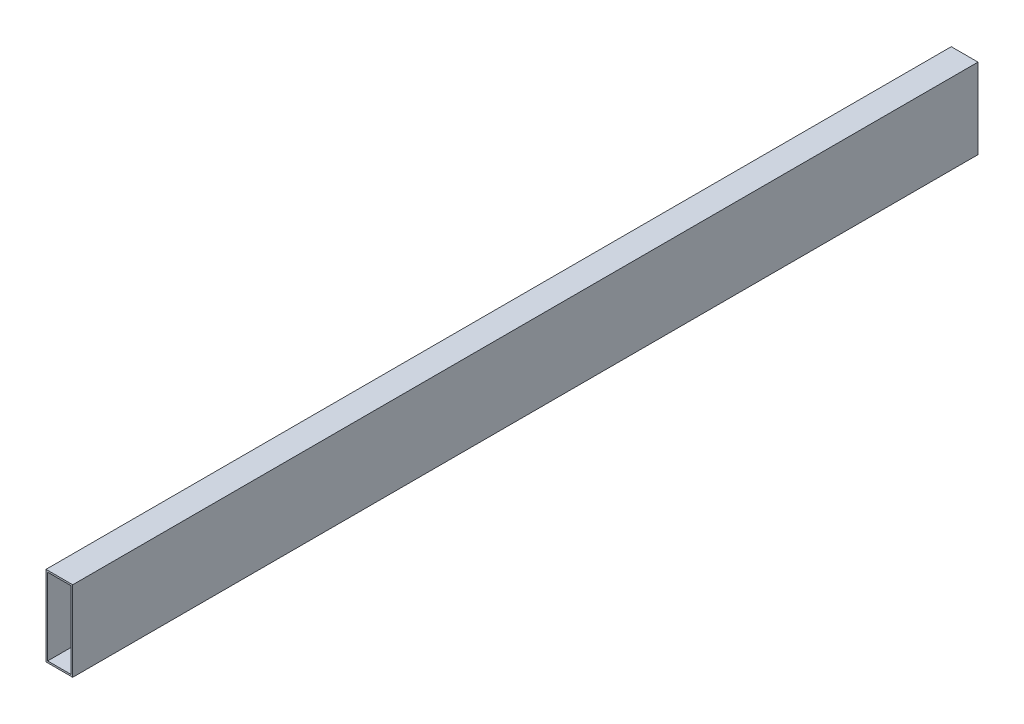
ISO-10303-21;
HEADER;
FILE_DESCRIPTION(('STEP AP214'),'2;1');
FILE_NAME('part.step','',(''),(''),'','','');
FILE_SCHEMA(('AUTOMOTIVE_DESIGN { 1 0 10303 214 1 1 1 1 }'));
ENDSEC;
DATA;
#1=APPLICATION_CONTEXT('core data for automotive mechanical design processes');
#2=APPLICATION_PROTOCOL_DEFINITION('international standard','automotive_design',2000,#1);
#3=PRODUCT_CONTEXT('',#1,'mechanical');
#4=PRODUCT('Part','Part','',(#3));
#5=PRODUCT_RELATED_PRODUCT_CATEGORY('part','',(#4));
#6=PRODUCT_DEFINITION_FORMATION('','',#4);
#7=PRODUCT_DEFINITION_CONTEXT('part definition',#1,'design');
#8=PRODUCT_DEFINITION('design','',#6,#7);
#9=PRODUCT_DEFINITION_SHAPE('','',#8);
#10=(LENGTH_UNIT() NAMED_UNIT(*) SI_UNIT(.MILLI.,.METRE.));
#11=(NAMED_UNIT(*) PLANE_ANGLE_UNIT() SI_UNIT($,.RADIAN.));
#12=(NAMED_UNIT(*) SI_UNIT($,.STERADIAN.) SOLID_ANGLE_UNIT());
#13=UNCERTAINTY_MEASURE_WITH_UNIT(LENGTH_MEASURE(1.E-05),#10,'distance_accuracy_value','');
#14=(GEOMETRIC_REPRESENTATION_CONTEXT(3) GLOBAL_UNCERTAINTY_ASSIGNED_CONTEXT((#13)) GLOBAL_UNIT_ASSIGNED_CONTEXT((#10,
#11,#12)) REPRESENTATION_CONTEXT('',''));
#15=CARTESIAN_POINT('',(0.,0.,0.));
#16=DIRECTION('',(0.,0.,1.));
#17=DIRECTION('',(1.,0.,0.));
#18=AXIS2_PLACEMENT_3D('',#15,#16,#17);
#19=CARTESIAN_POINT('',(50.8,152.4,0.));
#20=DIRECTION('',(0.,1.,0.));
#21=DIRECTION('',(0.,0.,1.));
#22=AXIS2_PLACEMENT_3D('',#19,#20,#21);
#23=PLANE('',#22);
#24=DIRECTION('',(-1.,0.,0.));
#25=VECTOR('',#24,1.);
#26=CARTESIAN_POINT('',(50.8,152.4,1720.85));
#27=LINE('',#26,#25);
#28=CARTESIAN_POINT('',(50.8,152.4,1720.85));
#29=VERTEX_POINT('',#28);
#30=CARTESIAN_POINT('',(0.,152.4,1720.85));
#31=VERTEX_POINT('',#30);
#32=EDGE_CURVE('E129',#29,#31,#27,.T.);
#33=ORIENTED_EDGE('',*,*,#32,.F.);
#34=DIRECTION('',(0.,0.,1.));
#35=VECTOR('',#34,1.);
#36=CARTESIAN_POINT('',(50.8,152.4,0.));
#37=LINE('',#36,#35);
#38=CARTESIAN_POINT('',(50.8,152.4,0.));
#39=VERTEX_POINT('',#38);
#40=EDGE_CURVE('E11',#39,#29,#37,.T.);
#41=ORIENTED_EDGE('',*,*,#40,.F.);
#42=DIRECTION('',(-1.,0.,0.));
#43=VECTOR('',#42,1.);
#44=CARTESIAN_POINT('',(50.8,152.4,0.));
#45=LINE('',#44,#43);
#46=CARTESIAN_POINT('',(0.,152.4,0.));
#47=VERTEX_POINT('',#46);
#48=EDGE_CURVE('E133',#39,#47,#45,.T.);
#49=ORIENTED_EDGE('',*,*,#48,.T.);
#50=DIRECTION('',(0.,0.,1.));
#51=VECTOR('',#50,1.);
#52=CARTESIAN_POINT('',(0.,152.4,0.));
#53=LINE('',#52,#51);
#54=EDGE_CURVE('E34',#47,#31,#53,.T.);
#55=ORIENTED_EDGE('',*,*,#54,.T.);
#56=EDGE_LOOP('',(#33,#41,#49,#55));
#57=FACE_BOUND('',#56,.T.);
#58=ADVANCED_FACE('F31',(#57),#23,.T.);
#59=CARTESIAN_POINT('',(50.8,0.,0.));
#60=DIRECTION('',(1.,0.,0.));
#61=DIRECTION('',(0.,0.,-1.));
#62=AXIS2_PLACEMENT_3D('',#59,#60,#61);
#63=PLANE('',#62);
#64=DIRECTION('',(0.,1.,0.));
#65=VECTOR('',#64,1.);
#66=CARTESIAN_POINT('',(50.8,0.,1720.85));
#67=LINE('',#66,#65);
#68=CARTESIAN_POINT('',(50.8,0.,1720.85));
#69=VERTEX_POINT('',#68);
#70=EDGE_CURVE('E137',#69,#29,#67,.T.);
#71=ORIENTED_EDGE('',*,*,#70,.F.);
#72=DIRECTION('',(0.,0.,1.));
#73=VECTOR('',#72,1.);
#74=CARTESIAN_POINT('',(50.8,0.,0.));
#75=LINE('',#74,#73);
#76=CARTESIAN_POINT('',(50.8,0.,0.));
#77=VERTEX_POINT('',#76);
#78=EDGE_CURVE('E39',#77,#69,#75,.T.);
#79=ORIENTED_EDGE('',*,*,#78,.F.);
#80=DIRECTION('',(0.,1.,0.));
#81=VECTOR('',#80,1.);
#82=CARTESIAN_POINT('',(50.8,0.,0.));
#83=LINE('',#82,#81);
#84=EDGE_CURVE('E143',#77,#39,#83,.T.);
#85=ORIENTED_EDGE('',*,*,#84,.T.);
#86=ORIENTED_EDGE('',*,*,#40,.T.);
#87=EDGE_LOOP('',(#71,#79,#85,#86));
#88=FACE_BOUND('',#87,.T.);
#89=ADVANCED_FACE('F169',(#88),#63,.T.);
#90=CARTESIAN_POINT('',(0.,0.,0.));
#91=DIRECTION('',(0.,-1.,0.));
#92=DIRECTION('',(0.,0.,-1.));
#93=AXIS2_PLACEMENT_3D('',#90,#91,#92);
#94=PLANE('',#93);
#95=DIRECTION('',(1.,0.,0.));
#96=VECTOR('',#95,1.);
#97=CARTESIAN_POINT('',(0.,0.,1720.85));
#98=LINE('',#97,#96);
#99=CARTESIAN_POINT('',(0.,0.,1720.85));
#100=VERTEX_POINT('',#99);
#101=EDGE_CURVE('E151',#100,#69,#98,.T.);
#102=ORIENTED_EDGE('',*,*,#101,.F.);
#103=DIRECTION('',(0.,0.,1.));
#104=VECTOR('',#103,1.);
#105=CARTESIAN_POINT('',(0.,0.,0.));
#106=LINE('',#105,#104);
#107=CARTESIAN_POINT('',(0.,0.,0.));
#108=VERTEX_POINT('',#107);
#109=EDGE_CURVE('E156',#108,#100,#106,.T.);
#110=ORIENTED_EDGE('',*,*,#109,.F.);
#111=DIRECTION('',(1.,0.,0.));
#112=VECTOR('',#111,1.);
#113=CARTESIAN_POINT('',(0.,0.,0.));
#114=LINE('',#113,#112);
#115=EDGE_CURVE('E140',#108,#77,#114,.T.);
#116=ORIENTED_EDGE('',*,*,#115,.T.);
#117=ORIENTED_EDGE('',*,*,#78,.T.);
#118=EDGE_LOOP('',(#102,#110,#116,#117));
#119=FACE_BOUND('',#118,.T.);
#120=ADVANCED_FACE('F173',(#119),#94,.T.);
#121=CARTESIAN_POINT('',(0.,152.4,0.));
#122=DIRECTION('',(-1.,0.,0.));
#123=DIRECTION('',(0.,-1.,0.));
#124=AXIS2_PLACEMENT_3D('',#121,#122,#123);
#125=PLANE('',#124);
#126=DIRECTION('',(0.,-1.,0.));
#127=VECTOR('',#126,1.);
#128=CARTESIAN_POINT('',(0.,152.4,1720.85));
#129=LINE('',#128,#127);
#130=EDGE_CURVE('E148',#31,#100,#129,.T.);
#131=ORIENTED_EDGE('',*,*,#130,.F.);
#132=ORIENTED_EDGE('',*,*,#54,.F.);
#133=DIRECTION('',(0.,-1.,0.));
#134=VECTOR('',#133,1.);
#135=CARTESIAN_POINT('',(0.,152.4,0.));
#136=LINE('',#135,#134);
#137=EDGE_CURVE('E136',#47,#108,#136,.T.);
#138=ORIENTED_EDGE('',*,*,#137,.T.);
#139=ORIENTED_EDGE('',*,*,#109,.T.);
#140=EDGE_LOOP('',(#131,#132,#138,#139));
#141=FACE_BOUND('',#140,.T.);
#142=ADVANCED_FACE('F164',(#141),#125,.T.);
#143=CARTESIAN_POINT('',(0.,152.4,0.));
#144=DIRECTION('',(0.,0.,1.));
#145=DIRECTION('',(1.,0.,0.));
#146=AXIS2_PLACEMENT_3D('',#143,#144,#145);
#147=PLANE('',#146);
#148=DIRECTION('',(0.,-1.,0.));
#149=VECTOR('',#148,1.);
#150=CARTESIAN_POINT('',(3.175,3.175,0.));
#151=LINE('',#150,#149);
#152=CARTESIAN_POINT('',(3.17499999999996,149.225,0.));
#153=VERTEX_POINT('',#152);
#154=CARTESIAN_POINT('',(3.175,3.175,0.));
#155=VERTEX_POINT('',#154);
#156=EDGE_CURVE('E104',#153,#155,#151,.T.);
#157=ORIENTED_EDGE('',*,*,#156,.T.);
#158=DIRECTION('',(1.,0.,0.));
#159=VECTOR('',#158,1.);
#160=CARTESIAN_POINT('',(47.625,3.175,0.));
#161=LINE('',#160,#159);
#162=CARTESIAN_POINT('',(47.625,3.175,0.));
#163=VERTEX_POINT('',#162);
#164=EDGE_CURVE('E98',#155,#163,#161,.T.);
#165=ORIENTED_EDGE('',*,*,#164,.T.);
#166=DIRECTION('',(0.,1.,0.));
#167=VECTOR('',#166,1.);
#168=CARTESIAN_POINT('',(47.625,149.225,0.));
#169=LINE('',#168,#167);
#170=CARTESIAN_POINT('',(47.625,149.225,0.));
#171=VERTEX_POINT('',#170);
#172=EDGE_CURVE('E107',#163,#171,#169,.T.);
#173=ORIENTED_EDGE('',*,*,#172,.T.);
#174=DIRECTION('',(-1.,0.,0.));
#175=VECTOR('',#174,1.);
#176=CARTESIAN_POINT('',(3.17499999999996,149.225,0.));
#177=LINE('',#176,#175);
#178=EDGE_CURVE('E47',#171,#153,#177,.T.);
#179=ORIENTED_EDGE('',*,*,#178,.T.);
#180=EDGE_LOOP('',(#157,#165,#173,#179));
#181=FACE_BOUND('',#180,.T.);
#182=ORIENTED_EDGE('',*,*,#48,.F.);
#183=ORIENTED_EDGE('',*,*,#84,.F.);
#184=ORIENTED_EDGE('',*,*,#115,.F.);
#185=ORIENTED_EDGE('',*,*,#137,.F.);
#186=EDGE_LOOP('',(#182,#183,#184,#185));
#187=FACE_BOUND('',#186,.T.);
#188=ADVANCED_FACE('F111',(#181,#187),#147,.F.);
#189=CARTESIAN_POINT('',(0.,152.4,1720.85));
#190=DIRECTION('',(0.,0.,1.));
#191=DIRECTION('',(1.,0.,0.));
#192=AXIS2_PLACEMENT_3D('',#189,#190,#191);
#193=PLANE('',#192);
#194=DIRECTION('',(1.,0.,0.));
#195=VECTOR('',#194,1.);
#196=CARTESIAN_POINT('',(47.625,3.175,1720.85));
#197=LINE('',#196,#195);
#198=CARTESIAN_POINT('',(3.175,3.175,1720.85));
#199=VERTEX_POINT('',#198);
#200=CARTESIAN_POINT('',(47.625,3.17500000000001,1720.85));
#201=VERTEX_POINT('',#200);
#202=EDGE_CURVE('E55',#199,#201,#197,.T.);
#203=ORIENTED_EDGE('',*,*,#202,.F.);
#204=DIRECTION('',(0.,-1.,0.));
#205=VECTOR('',#204,1.);
#206=CARTESIAN_POINT('',(3.175,3.175,1720.85));
#207=LINE('',#206,#205);
#208=CARTESIAN_POINT('',(3.17499999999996,149.225,1720.85));
#209=VERTEX_POINT('',#208);
#210=EDGE_CURVE('E114',#209,#199,#207,.T.);
#211=ORIENTED_EDGE('',*,*,#210,.F.);
#212=DIRECTION('',(-1.,0.,0.));
#213=VECTOR('',#212,1.);
#214=CARTESIAN_POINT('',(3.17499999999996,149.225,1720.85));
#215=LINE('',#214,#213);
#216=CARTESIAN_POINT('',(47.625,149.225,1720.85));
#217=VERTEX_POINT('',#216);
#218=EDGE_CURVE('E117',#217,#209,#215,.T.);
#219=ORIENTED_EDGE('',*,*,#218,.F.);
#220=DIRECTION('',(0.,1.,0.));
#221=VECTOR('',#220,1.);
#222=CARTESIAN_POINT('',(47.625,149.225,1720.85));
#223=LINE('',#222,#221);
#224=EDGE_CURVE('E123',#201,#217,#223,.T.);
#225=ORIENTED_EDGE('',*,*,#224,.F.);
#226=EDGE_LOOP('',(#203,#211,#219,#225));
#227=FACE_BOUND('',#226,.T.);
#228=ORIENTED_EDGE('',*,*,#32,.T.);
#229=ORIENTED_EDGE('',*,*,#130,.T.);
#230=ORIENTED_EDGE('',*,*,#101,.T.);
#231=ORIENTED_EDGE('',*,*,#70,.T.);
#232=EDGE_LOOP('',(#228,#229,#230,#231));
#233=FACE_BOUND('',#232,.T.);
#234=ADVANCED_FACE('F166',(#227,#233),#193,.T.);
#235=CARTESIAN_POINT('',(47.625,3.175,0.));
#236=DIRECTION('',(0.,-1.,0.));
#237=DIRECTION('',(0.,0.,-1.));
#238=AXIS2_PLACEMENT_3D('',#235,#236,#237);
#239=PLANE('',#238);
#240=ORIENTED_EDGE('',*,*,#202,.T.);
#241=DIRECTION('',(0.,0.,1.));
#242=VECTOR('',#241,1.);
#243=CARTESIAN_POINT('',(47.625,3.175,0.));
#244=LINE('',#243,#242);
#245=EDGE_CURVE('E94',#163,#201,#244,.T.);
#246=ORIENTED_EDGE('',*,*,#245,.F.);
#247=ORIENTED_EDGE('',*,*,#164,.F.);
#248=DIRECTION('',(0.,0.,1.));
#249=VECTOR('',#248,1.);
#250=CARTESIAN_POINT('',(3.175,3.175,0.));
#251=LINE('',#250,#249);
#252=EDGE_CURVE('E127',#155,#199,#251,.T.);
#253=ORIENTED_EDGE('',*,*,#252,.T.);
#254=EDGE_LOOP('',(#240,#246,#247,#253));
#255=FACE_BOUND('',#254,.T.);
#256=ADVANCED_FACE('F96',(#255),#239,.F.);
#257=CARTESIAN_POINT('',(3.175,3.175,0.));
#258=DIRECTION('',(-1.,0.,0.));
#259=DIRECTION('',(0.,-1.,0.));
#260=AXIS2_PLACEMENT_3D('',#257,#258,#259);
#261=PLANE('',#260);
#262=ORIENTED_EDGE('',*,*,#210,.T.);
#263=ORIENTED_EDGE('',*,*,#252,.F.);
#264=ORIENTED_EDGE('',*,*,#156,.F.);
#265=DIRECTION('',(0.,0.,1.));
#266=VECTOR('',#265,1.);
#267=CARTESIAN_POINT('',(3.17499999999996,149.225,0.));
#268=LINE('',#267,#266);
#269=EDGE_CURVE('E130',#153,#209,#268,.T.);
#270=ORIENTED_EDGE('',*,*,#269,.T.);
#271=EDGE_LOOP('',(#262,#263,#264,#270));
#272=FACE_BOUND('',#271,.T.);
#273=ADVANCED_FACE('F224',(#272),#261,.F.);
#274=CARTESIAN_POINT('',(3.17499999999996,149.225,0.));
#275=DIRECTION('',(0.,1.,0.));
#276=DIRECTION('',(0.,0.,1.));
#277=AXIS2_PLACEMENT_3D('',#274,#275,#276);
#278=PLANE('',#277);
#279=ORIENTED_EDGE('',*,*,#218,.T.);
#280=ORIENTED_EDGE('',*,*,#269,.F.);
#281=ORIENTED_EDGE('',*,*,#178,.F.);
#282=DIRECTION('',(0.,0.,1.));
#283=VECTOR('',#282,1.);
#284=CARTESIAN_POINT('',(47.625,149.225,0.));
#285=LINE('',#284,#283);
#286=EDGE_CURVE('E103',#171,#217,#285,.T.);
#287=ORIENTED_EDGE('',*,*,#286,.T.);
#288=EDGE_LOOP('',(#279,#280,#281,#287));
#289=FACE_BOUND('',#288,.T.);
#290=ADVANCED_FACE('F233',(#289),#278,.F.);
#291=CARTESIAN_POINT('',(47.625,149.225,0.));
#292=DIRECTION('',(1.,0.,0.));
#293=DIRECTION('',(0.,0.,-1.));
#294=AXIS2_PLACEMENT_3D('',#291,#292,#293);
#295=PLANE('',#294);
#296=ORIENTED_EDGE('',*,*,#224,.T.);
#297=ORIENTED_EDGE('',*,*,#286,.F.);
#298=ORIENTED_EDGE('',*,*,#172,.F.);
#299=ORIENTED_EDGE('',*,*,#245,.T.);
#300=EDGE_LOOP('',(#296,#297,#298,#299));
#301=FACE_BOUND('',#300,.T.);
#302=ADVANCED_FACE('F108',(#301),#295,.F.);
#303=CLOSED_SHELL('',(#58,#89,#120,#142,#188,#234,#256,#273,#290,#302));
#304=MANIFOLD_SOLID_BREP('B2',#303);
#305=ADVANCED_BREP_SHAPE_REPRESENTATION('',(#18,#304),#14);
#306=SHAPE_DEFINITION_REPRESENTATION(#9,#305);
ENDSEC;
END-ISO-10303-21;
